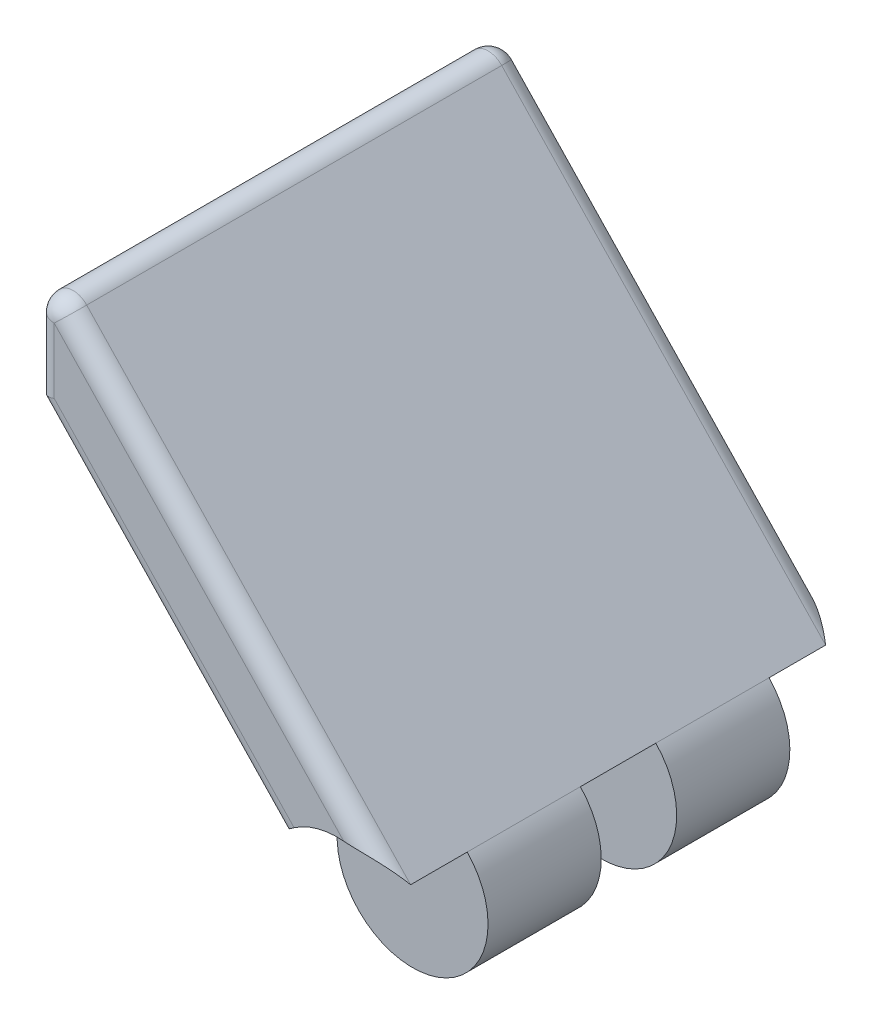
from build123d import *

# Parameters (mm, degrees)
EXTRUDE1_DEPTH = 15.239999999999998
FILLET1_R      = 1.27
EXTRUDE3_START = 5.08
SKETCH3_R      = 5.080000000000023
EXTRUDE3_DEPTH = 5.08
SKETCH4_R      = 5.080000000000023
EXTRUDE4_DEPTH = 277.7971508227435
SKETCH5_R      = 5.0800000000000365
EXTRUDE5_DEPTH = 277.79715082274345


with BuildPart() as part:
    # Sketch1 → Extrude1 (new, symmetric)
    with BuildSketch(Plane.XY):
        with BuildLine():
            Line((102.27743991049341, 232.1001333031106), (78.27935103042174, 257.29046943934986))
            Line((78.27935103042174, 257.29046943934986), (78.27935103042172, 249.2176143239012))
            Line((78.27935103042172, 249.2176143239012), (85.76485175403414, 241.36022699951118))
            Line((85.76485175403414, 241.36022699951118), (94.75797577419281, 231.92031625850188))
            ThreePointArc((94.75797577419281, 231.92031625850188), (98.72079711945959, 223.51757860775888), (102.27743991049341, 232.1001333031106))
        make_face()
    extrude(amount=EXTRUDE1_DEPTH, both=True)

    # Fillet1
    fillet1_edges = [part.edges().sort_by_distance(p)[0] for p in [
        (78.27935103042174, 253.25404188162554, 15.239999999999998),
        (86.51866340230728, 240.56896529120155, 15.239999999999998),
        (98.72079711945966, 223.51757860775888, 15.239999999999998),
        (86.51866340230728, 240.56896529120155, -15.239999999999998),
        (78.27935103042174, 253.25404188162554, -15.239999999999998),
        (90.27839547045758, 244.69530137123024, -15.239999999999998),
        (98.72079711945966, 223.51757860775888, -15.239999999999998),
        (90.27839547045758, 244.69530137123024, 15.239999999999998),
        (78.27935103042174, 257.29046943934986, 0),
    ]]
    fillet(fillet1_edges, radius=FILLET1_R)

    # Sketch3 → Extrude3 (cut)
    with BuildSketch(Plane.XY.offset(-2.54).offset(EXTRUDE3_START)):
        with Locations((98.59935103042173, 228.5961267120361)):
            Circle(SKETCH3_R)
    extrude(amount=-EXTRUDE3_DEPTH, mode=Mode.SUBTRACT)

    # Sketch4 → Extrude4 (cut, through all)
    with BuildSketch(Plane.XY.offset(10.159999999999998)):
        with Locations((98.59935103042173, 228.5961267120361)):
            Circle(SKETCH4_R)
    extrude(amount=EXTRUDE4_DEPTH, mode=Mode.SUBTRACT)

    # Sketch5 → Extrude5 (cut, through all)
    with BuildSketch(Plane.XY.offset(-10.159999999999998)):
        with Locations((98.59935103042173, 228.5961267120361)):
            Circle(SKETCH5_R)
    extrude(amount=-EXTRUDE5_DEPTH, mode=Mode.SUBTRACT)


solid = part.part
